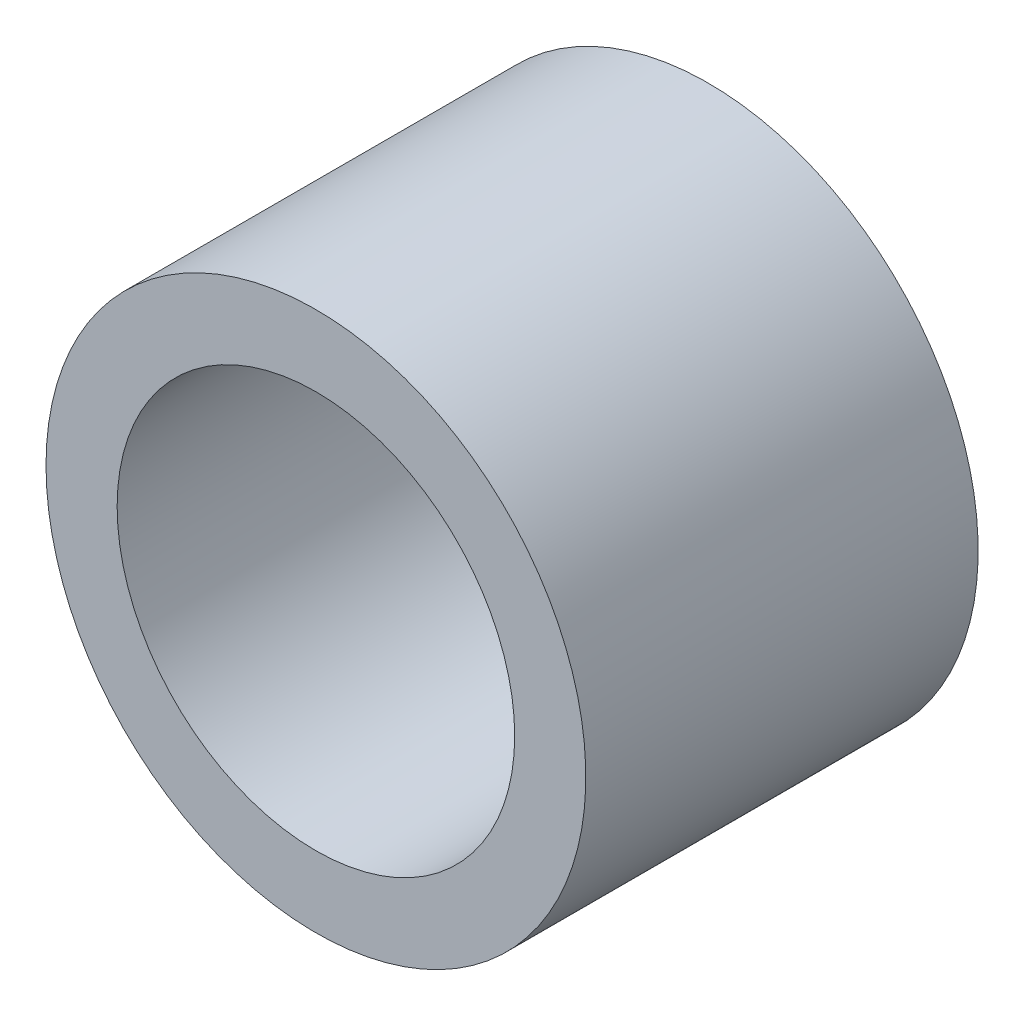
ISO-10303-21;
HEADER;
FILE_DESCRIPTION(('STEP AP214'),'2;1');
FILE_NAME('part.step','',(''),(''),'','','');
FILE_SCHEMA(('AUTOMOTIVE_DESIGN { 1 0 10303 214 1 1 1 1 }'));
ENDSEC;
DATA;
#1=APPLICATION_CONTEXT('core data for automotive mechanical design processes');
#2=APPLICATION_PROTOCOL_DEFINITION('international standard','automotive_design',2000,#1);
#3=PRODUCT_CONTEXT('',#1,'mechanical');
#4=PRODUCT('Part','Part','',(#3));
#5=PRODUCT_RELATED_PRODUCT_CATEGORY('part','',(#4));
#6=PRODUCT_DEFINITION_FORMATION('','',#4);
#7=PRODUCT_DEFINITION_CONTEXT('part definition',#1,'design');
#8=PRODUCT_DEFINITION('design','',#6,#7);
#9=PRODUCT_DEFINITION_SHAPE('','',#8);
#10=(LENGTH_UNIT() NAMED_UNIT(*) SI_UNIT(.MILLI.,.METRE.));
#11=(NAMED_UNIT(*) PLANE_ANGLE_UNIT() SI_UNIT($,.RADIAN.));
#12=(NAMED_UNIT(*) SI_UNIT($,.STERADIAN.) SOLID_ANGLE_UNIT());
#13=UNCERTAINTY_MEASURE_WITH_UNIT(LENGTH_MEASURE(1.E-05),#10,'distance_accuracy_value','');
#14=(GEOMETRIC_REPRESENTATION_CONTEXT(3) GLOBAL_UNCERTAINTY_ASSIGNED_CONTEXT((#13)) GLOBAL_UNIT_ASSIGNED_CONTEXT((#10,
#11,#12)) REPRESENTATION_CONTEXT('',''));
#15=CARTESIAN_POINT('',(0.,0.,0.));
#16=DIRECTION('',(0.,0.,1.));
#17=DIRECTION('',(1.,0.,0.));
#18=AXIS2_PLACEMENT_3D('',#15,#16,#17);
#19=CARTESIAN_POINT('',(0.,0.,19.05));
#20=DIRECTION('',(0.,0.,-1.));
#21=DIRECTION('',(-1.,0.,0.));
#22=AXIS2_PLACEMENT_3D('',#19,#20,#21);
#23=CYLINDRICAL_SURFACE('',#22,9.652);
#24=CARTESIAN_POINT('',(0.,0.,0.));
#25=DIRECTION('',(0.,0.,-1.));
#26=DIRECTION('',(-1.,0.,0.));
#27=AXIS2_PLACEMENT_3D('',#24,#25,#26);
#28=CIRCLE('',#27,9.652);
#29=CARTESIAN_POINT('',(-9.652,0.,0.));
#30=VERTEX_POINT('',#29);
#31=EDGE_CURVE('E24',#30,#30,#28,.T.);
#32=ORIENTED_EDGE('',*,*,#31,.T.);
#33=EDGE_LOOP('',(#32));
#34=FACE_BOUND('',#33,.T.);
#35=CARTESIAN_POINT('',(0.,0.,19.05));
#36=DIRECTION('',(0.,0.,-1.));
#37=DIRECTION('',(-1.,0.,0.));
#38=AXIS2_PLACEMENT_3D('',#35,#36,#37);
#39=CIRCLE('',#38,9.652);
#40=CARTESIAN_POINT('',(-9.652,0.,19.05));
#41=VERTEX_POINT('',#40);
#42=EDGE_CURVE('E15',#41,#41,#39,.T.);
#43=ORIENTED_EDGE('',*,*,#42,.F.);
#44=EDGE_LOOP('',(#43));
#45=FACE_BOUND('',#44,.T.);
#46=ADVANCED_FACE('F12',(#34,#45),#23,.F.);
#47=CARTESIAN_POINT('',(0.,0.,19.05));
#48=DIRECTION('',(0.,0.,1.));
#49=DIRECTION('',(1.,0.,0.));
#50=AXIS2_PLACEMENT_3D('',#47,#48,#49);
#51=PLANE('',#50);
#52=ORIENTED_EDGE('',*,*,#42,.T.);
#53=EDGE_LOOP('',(#52));
#54=FACE_BOUND('',#53,.T.);
#55=CARTESIAN_POINT('',(0.,0.,19.05));
#56=DIRECTION('',(0.,0.,-1.));
#57=DIRECTION('',(-1.,0.,0.));
#58=AXIS2_PLACEMENT_3D('',#55,#56,#57);
#59=CIRCLE('',#58,13.1064);
#60=CARTESIAN_POINT('',(-13.1064,0.,19.05));
#61=VERTEX_POINT('',#60);
#62=EDGE_CURVE('E19',#61,#61,#59,.T.);
#63=ORIENTED_EDGE('',*,*,#62,.F.);
#64=EDGE_LOOP('',(#63));
#65=FACE_BOUND('',#64,.T.);
#66=ADVANCED_FACE('F32',(#54,#65),#51,.T.);
#67=CARTESIAN_POINT('',(0.,0.,0.));
#68=DIRECTION('',(0.,0.,1.));
#69=DIRECTION('',(1.,0.,0.));
#70=AXIS2_PLACEMENT_3D('',#67,#68,#69);
#71=PLANE('',#70);
#72=ORIENTED_EDGE('',*,*,#31,.F.);
#73=EDGE_LOOP('',(#72));
#74=FACE_BOUND('',#73,.T.);
#75=CARTESIAN_POINT('',(0.,0.,0.));
#76=DIRECTION('',(0.,0.,-1.));
#77=DIRECTION('',(-1.,0.,0.));
#78=AXIS2_PLACEMENT_3D('',#75,#76,#77);
#79=CIRCLE('',#78,13.1064);
#80=CARTESIAN_POINT('',(-13.1064,0.,0.));
#81=VERTEX_POINT('',#80);
#82=EDGE_CURVE('E8',#81,#81,#79,.F.);
#83=ORIENTED_EDGE('',*,*,#82,.F.);
#84=EDGE_LOOP('',(#83));
#85=FACE_BOUND('',#84,.T.);
#86=ADVANCED_FACE('F40',(#74,#85),#71,.F.);
#87=CARTESIAN_POINT('',(0.,0.,19.05));
#88=DIRECTION('',(0.,0.,-1.));
#89=DIRECTION('',(-1.,0.,0.));
#90=AXIS2_PLACEMENT_3D('',#87,#88,#89);
#91=CYLINDRICAL_SURFACE('',#90,13.1064);
#92=ORIENTED_EDGE('',*,*,#82,.T.);
#93=EDGE_LOOP('',(#92));
#94=FACE_BOUND('',#93,.T.);
#95=ORIENTED_EDGE('',*,*,#62,.T.);
#96=EDGE_LOOP('',(#95));
#97=FACE_BOUND('',#96,.T.);
#98=ADVANCED_FACE('F41',(#94,#97),#91,.T.);
#99=CLOSED_SHELL('',(#46,#66,#86,#98));
#100=MANIFOLD_SOLID_BREP('B1',#99);
#101=ADVANCED_BREP_SHAPE_REPRESENTATION('',(#18,#100),#14);
#102=SHAPE_DEFINITION_REPRESENTATION(#9,#101);
ENDSEC;
END-ISO-10303-21;
